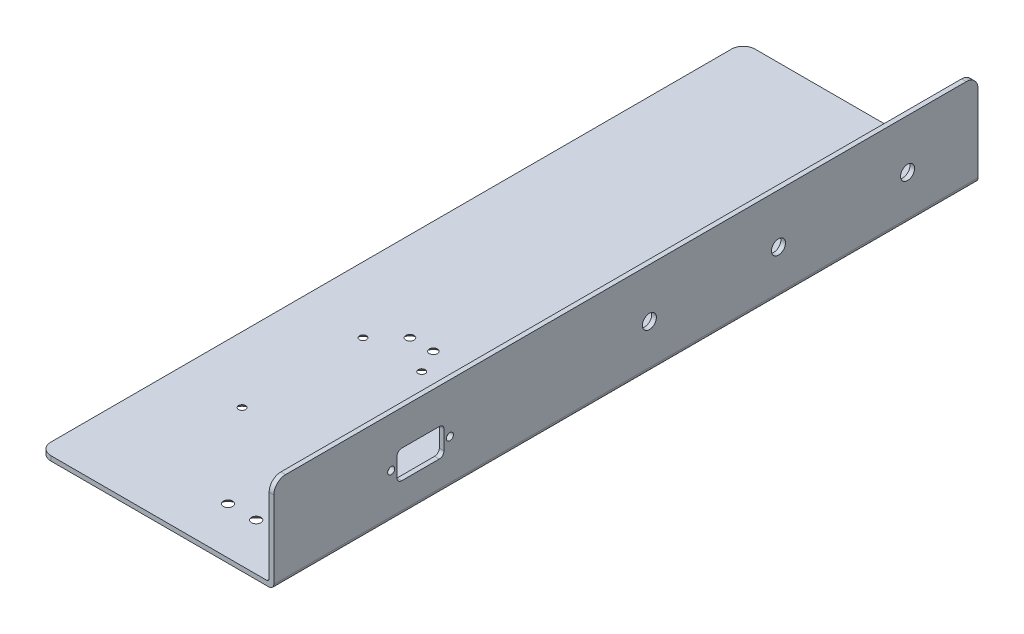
ISO-10303-21;
HEADER;
FILE_DESCRIPTION(('STEP AP214'),'2;1');
FILE_NAME('part.step','',(''),(''),'','','');
FILE_SCHEMA(('AUTOMOTIVE_DESIGN { 1 0 10303 214 1 1 1 1 }'));
ENDSEC;
DATA;
#1=APPLICATION_CONTEXT('core data for automotive mechanical design processes');
#2=APPLICATION_PROTOCOL_DEFINITION('international standard','automotive_design',2000,#1);
#3=PRODUCT_CONTEXT('',#1,'mechanical');
#4=PRODUCT('Part','Part','',(#3));
#5=PRODUCT_RELATED_PRODUCT_CATEGORY('part','',(#4));
#6=PRODUCT_DEFINITION_FORMATION('','',#4);
#7=PRODUCT_DEFINITION_CONTEXT('part definition',#1,'design');
#8=PRODUCT_DEFINITION('design','',#6,#7);
#9=PRODUCT_DEFINITION_SHAPE('','',#8);
#10=(LENGTH_UNIT() NAMED_UNIT(*) SI_UNIT(.MILLI.,.METRE.));
#11=(NAMED_UNIT(*) PLANE_ANGLE_UNIT() SI_UNIT($,.RADIAN.));
#12=(NAMED_UNIT(*) SI_UNIT($,.STERADIAN.) SOLID_ANGLE_UNIT());
#13=UNCERTAINTY_MEASURE_WITH_UNIT(LENGTH_MEASURE(1.E-05),#10,'distance_accuracy_value','');
#14=(GEOMETRIC_REPRESENTATION_CONTEXT(3) GLOBAL_UNCERTAINTY_ASSIGNED_CONTEXT((#13)) GLOBAL_UNIT_ASSIGNED_CONTEXT((#10,
#11,#12)) REPRESENTATION_CONTEXT('',''));
#15=CARTESIAN_POINT('',(0.,0.,0.));
#16=DIRECTION('',(0.,0.,1.));
#17=DIRECTION('',(1.,0.,0.));
#18=AXIS2_PLACEMENT_3D('',#15,#16,#17);
#19=CARTESIAN_POINT('',(-100.,1.99999999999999,300.));
#20=DIRECTION('',(1.,0.,0.));
#21=DIRECTION('',(0.,0.,-1.));
#22=AXIS2_PLACEMENT_3D('',#19,#20,#21);
#23=PLANE('',#22);
#24=DIRECTION('',(0.,0.,-1.));
#25=VECTOR('',#24,1.);
#26=CARTESIAN_POINT('',(-100.,1.99999999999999,300.));
#27=LINE('',#26,#25);
#28=CARTESIAN_POINT('',(-100.,1.99999999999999,295.));
#29=VERTEX_POINT('',#28);
#30=CARTESIAN_POINT('',(-100.,1.99999999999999,5.));
#31=VERTEX_POINT('',#30);
#32=EDGE_CURVE('E208',#29,#31,#27,.T.);
#33=ORIENTED_EDGE('',*,*,#32,.T.);
#34=DIRECTION('',(0.,-1.,0.));
#35=VECTOR('',#34,1.);
#36=CARTESIAN_POINT('',(-100.,1.99999999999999,5.));
#37=LINE('',#36,#35);
#38=CARTESIAN_POINT('',(-100.,0.,5.));
#39=VERTEX_POINT('',#38);
#40=EDGE_CURVE('E324',#31,#39,#37,.T.);
#41=ORIENTED_EDGE('',*,*,#40,.T.);
#42=DIRECTION('',(0.,0.,-1.));
#43=VECTOR('',#42,1.);
#44=CARTESIAN_POINT('',(-100.,0.,300.));
#45=LINE('',#44,#43);
#46=CARTESIAN_POINT('',(-100.,0.,295.));
#47=VERTEX_POINT('',#46);
#48=EDGE_CURVE('E217',#47,#39,#45,.T.);
#49=ORIENTED_EDGE('',*,*,#48,.F.);
#50=DIRECTION('',(0.,-1.,0.));
#51=VECTOR('',#50,1.);
#52=CARTESIAN_POINT('',(-100.,1.99999999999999,295.));
#53=LINE('',#52,#51);
#54=EDGE_CURVE('E322',#47,#29,#53,.F.);
#55=ORIENTED_EDGE('',*,*,#54,.T.);
#56=EDGE_LOOP('',(#33,#41,#49,#55));
#57=FACE_BOUND('',#56,.T.);
#58=ADVANCED_FACE('F35',(#57),#23,.F.);
#59=CARTESIAN_POINT('',(-100.,0.,300.));
#60=DIRECTION('',(0.,1.,0.));
#61=DIRECTION('',(0.,0.,1.));
#62=AXIS2_PLACEMENT_3D('',#59,#60,#61);
#63=PLANE('',#62);
#64=CARTESIAN_POINT('',(-27.5,0.,280.));
#65=DIRECTION('',(0.,1.,0.));
#66=DIRECTION('',(0.,0.,1.));
#67=AXIS2_PLACEMENT_3D('',#64,#65,#66);
#68=CIRCLE('',#67,4.);
#69=CARTESIAN_POINT('',(-27.5,0.,284.));
#70=VERTEX_POINT('',#69);
#71=EDGE_CURVE('E303',#70,#70,#68,.T.);
#72=ORIENTED_EDGE('',*,*,#71,.T.);
#73=EDGE_LOOP('',(#72));
#74=FACE_BOUND('',#73,.T.);
#75=CARTESIAN_POINT('',(-39.5,0.,280.));
#76=DIRECTION('',(0.,1.,0.));
#77=DIRECTION('',(0.,0.,1.));
#78=AXIS2_PLACEMENT_3D('',#75,#76,#77);
#79=CIRCLE('',#78,4.);
#80=CARTESIAN_POINT('',(-39.5,0.,284.));
#81=VERTEX_POINT('',#80);
#82=EDGE_CURVE('E295',#81,#81,#79,.T.);
#83=ORIENTED_EDGE('',*,*,#82,.T.);
#84=EDGE_LOOP('',(#83));
#85=FACE_BOUND('',#84,.T.);
#86=CARTESIAN_POINT('',(-52.,0.,180.));
#87=DIRECTION('',(0.,1.,0.));
#88=DIRECTION('',(0.,0.,1.));
#89=AXIS2_PLACEMENT_3D('',#86,#87,#88);
#90=CIRCLE('',#89,3.75);
#91=CARTESIAN_POINT('',(-52.,0.,183.75));
#92=VERTEX_POINT('',#91);
#93=EDGE_CURVE('E292',#92,#92,#90,.T.);
#94=ORIENTED_EDGE('',*,*,#93,.T.);
#95=EDGE_LOOP('',(#94));
#96=FACE_BOUND('',#95,.T.);
#97=CARTESIAN_POINT('',(-62.,0.,180.));
#98=DIRECTION('',(0.,1.,0.));
#99=DIRECTION('',(0.,0.,1.));
#100=AXIS2_PLACEMENT_3D('',#97,#98,#99);
#101=CIRCLE('',#100,3.75);
#102=CARTESIAN_POINT('',(-62.,0.,183.75));
#103=VERTEX_POINT('',#102);
#104=EDGE_CURVE('E289',#103,#103,#101,.T.);
#105=ORIENTED_EDGE('',*,*,#104,.T.);
#106=EDGE_LOOP('',(#105));
#107=FACE_BOUND('',#106,.T.);
#108=CARTESIAN_POINT('',(-72.,0.,241.5));
#109=DIRECTION('',(0.,1.,0.));
#110=DIRECTION('',(0.,0.,1.));
#111=AXIS2_PLACEMENT_3D('',#108,#109,#110);
#112=CIRCLE('',#111,3.5);
#113=CARTESIAN_POINT('',(-72.,0.,245.));
#114=VERTEX_POINT('',#113);
#115=EDGE_CURVE('E286',#114,#114,#112,.T.);
#116=ORIENTED_EDGE('',*,*,#115,.T.);
#117=EDGE_LOOP('',(#116));
#118=FACE_BOUND('',#117,.T.);
#119=CARTESIAN_POINT('',(-47.,0.,190.));
#120=DIRECTION('',(0.,1.,0.));
#121=DIRECTION('',(0.,0.,1.));
#122=AXIS2_PLACEMENT_3D('',#119,#120,#121);
#123=CIRCLE('',#122,3.49999999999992);
#124=CARTESIAN_POINT('',(-47.,0.,193.5));
#125=VERTEX_POINT('',#124);
#126=EDGE_CURVE('E283',#125,#125,#123,.T.);
#127=ORIENTED_EDGE('',*,*,#126,.T.);
#128=EDGE_LOOP('',(#127));
#129=FACE_BOUND('',#128,.T.);
#130=CARTESIAN_POINT('',(-72.,0.,190.));
#131=DIRECTION('',(0.,1.,0.));
#132=DIRECTION('',(0.,0.,1.));
#133=AXIS2_PLACEMENT_3D('',#130,#131,#132);
#134=CIRCLE('',#133,3.5);
#135=CARTESIAN_POINT('',(-72.,0.,193.5));
#136=VERTEX_POINT('',#135);
#137=EDGE_CURVE('E264',#136,#136,#134,.T.);
#138=ORIENTED_EDGE('',*,*,#137,.T.);
#139=EDGE_LOOP('',(#138));
#140=FACE_BOUND('',#139,.T.);
#141=ORIENTED_EDGE('',*,*,#48,.T.);
#142=CARTESIAN_POINT('',(-95.,0.,5.));
#143=DIRECTION('',(0.,1.,0.));
#144=DIRECTION('',(0.,0.,1.));
#145=AXIS2_PLACEMENT_3D('',#142,#143,#144);
#146=CIRCLE('',#145,5.);
#147=CARTESIAN_POINT('',(-95.,0.,0.));
#148=VERTEX_POINT('',#147);
#149=EDGE_CURVE('E329',#39,#148,#146,.F.);
#150=ORIENTED_EDGE('',*,*,#149,.T.);
#151=DIRECTION('',(1.,0.,0.));
#152=VECTOR('',#151,1.);
#153=CARTESIAN_POINT('',(-100.,0.,0.));
#154=LINE('',#153,#152);
#155=CARTESIAN_POINT('',(-2.,0.,0.));
#156=VERTEX_POINT('',#155);
#157=EDGE_CURVE('E224',#148,#156,#154,.T.);
#158=ORIENTED_EDGE('',*,*,#157,.T.);
#159=DIRECTION('',(0.,0.,-1.));
#160=VECTOR('',#159,1.);
#161=CARTESIAN_POINT('',(-2.,0.,300.));
#162=LINE('',#161,#160);
#163=CARTESIAN_POINT('',(-2.,0.,300.));
#164=VERTEX_POINT('',#163);
#165=EDGE_CURVE('E259',#156,#164,#162,.F.);
#166=ORIENTED_EDGE('',*,*,#165,.T.);
#167=DIRECTION('',(1.,0.,0.));
#168=VECTOR('',#167,1.);
#169=CARTESIAN_POINT('',(-100.,0.,300.));
#170=LINE('',#169,#168);
#171=CARTESIAN_POINT('',(-95.,0.,300.));
#172=VERTEX_POINT('',#171);
#173=EDGE_CURVE('E199',#172,#164,#170,.T.);
#174=ORIENTED_EDGE('',*,*,#173,.F.);
#175=CARTESIAN_POINT('',(-95.,0.,295.));
#176=DIRECTION('',(0.,1.,0.));
#177=DIRECTION('',(0.,0.,1.));
#178=AXIS2_PLACEMENT_3D('',#175,#176,#177);
#179=CIRCLE('',#178,5.);
#180=EDGE_CURVE('E327',#172,#47,#179,.F.);
#181=ORIENTED_EDGE('',*,*,#180,.T.);
#182=EDGE_LOOP('',(#141,#150,#158,#166,#174,#181));
#183=FACE_BOUND('',#182,.T.);
#184=ADVANCED_FACE('F459',(#74,#85,#96,#107,#118,#129,#140,#183),#63,.F.);
#185=CARTESIAN_POINT('',(0.,0.,300.));
#186=DIRECTION('',(-1.,0.,0.));
#187=DIRECTION('',(0.,0.,1.));
#188=AXIS2_PLACEMENT_3D('',#185,#186,#187);
#189=PLANE('',#188);
#190=CARTESIAN_POINT('',(0.,19.,225.));
#191=DIRECTION('',(1.,0.,0.));
#192=DIRECTION('',(0.,0.,-1.));
#193=AXIS2_PLACEMENT_3D('',#190,#191,#192);
#194=CIRCLE('',#193,1.5);
#195=CARTESIAN_POINT('',(0.,19.,223.5));
#196=VERTEX_POINT('',#195);
#197=EDGE_CURVE('E249',#196,#196,#194,.T.);
#198=ORIENTED_EDGE('',*,*,#197,.F.);
#199=EDGE_LOOP('',(#198));
#200=FACE_BOUND('',#199,.T.);
#201=CARTESIAN_POINT('',(0.,19.,250.));
#202=DIRECTION('',(1.,0.,0.));
#203=DIRECTION('',(0.,0.,-1.));
#204=AXIS2_PLACEMENT_3D('',#201,#202,#203);
#205=CIRCLE('',#204,1.5);
#206=CARTESIAN_POINT('',(0.,19.,248.5));
#207=VERTEX_POINT('',#206);
#208=EDGE_CURVE('E246',#207,#207,#205,.T.);
#209=ORIENTED_EDGE('',*,*,#208,.F.);
#210=EDGE_LOOP('',(#209));
#211=FACE_BOUND('',#210,.T.);
#212=DIRECTION('',(0.,0.,-1.));
#213=VECTOR('',#212,1.);
#214=CARTESIAN_POINT('',(0.,13.,247.5));
#215=LINE('',#214,#213);
#216=CARTESIAN_POINT('',(0.,13.,245.5));
#217=VERTEX_POINT('',#216);
#218=CARTESIAN_POINT('',(0.,13.,229.5));
#219=VERTEX_POINT('',#218);
#220=EDGE_CURVE('E399',#217,#219,#215,.T.);
#221=ORIENTED_EDGE('',*,*,#220,.F.);
#222=CARTESIAN_POINT('',(0.,15.,245.5));
#223=DIRECTION('',(-1.,0.,0.));
#224=DIRECTION('',(0.,0.,1.));
#225=AXIS2_PLACEMENT_3D('',#222,#223,#224);
#226=CIRCLE('',#225,2.);
#227=CARTESIAN_POINT('',(0.,15.,247.5));
#228=VERTEX_POINT('',#227);
#229=EDGE_CURVE('E368',#217,#228,#226,.T.);
#230=ORIENTED_EDGE('',*,*,#229,.T.);
#231=DIRECTION('',(0.,-1.,0.));
#232=VECTOR('',#231,1.);
#233=CARTESIAN_POINT('',(0.,25.,247.5));
#234=LINE('',#233,#232);
#235=CARTESIAN_POINT('',(0.,23.,247.5));
#236=VERTEX_POINT('',#235);
#237=EDGE_CURVE('E245',#236,#228,#234,.T.);
#238=ORIENTED_EDGE('',*,*,#237,.F.);
#239=CARTESIAN_POINT('',(0.,23.,245.5));
#240=DIRECTION('',(-1.,0.,0.));
#241=DIRECTION('',(0.,0.,1.));
#242=AXIS2_PLACEMENT_3D('',#239,#240,#241);
#243=CIRCLE('',#242,2.);
#244=CARTESIAN_POINT('',(0.,25.,245.5));
#245=VERTEX_POINT('',#244);
#246=EDGE_CURVE('E43',#236,#245,#243,.T.);
#247=ORIENTED_EDGE('',*,*,#246,.T.);
#248=DIRECTION('',(0.,0.,1.));
#249=VECTOR('',#248,1.);
#250=CARTESIAN_POINT('',(0.,25.,247.5));
#251=LINE('',#250,#249);
#252=CARTESIAN_POINT('',(0.,25.,229.5));
#253=VERTEX_POINT('',#252);
#254=EDGE_CURVE('E378',#253,#245,#251,.T.);
#255=ORIENTED_EDGE('',*,*,#254,.F.);
#256=CARTESIAN_POINT('',(0.,23.,229.5));
#257=DIRECTION('',(-1.,0.,0.));
#258=DIRECTION('',(0.,0.,1.));
#259=AXIS2_PLACEMENT_3D('',#256,#257,#258);
#260=CIRCLE('',#259,2.);
#261=CARTESIAN_POINT('',(0.,23.,227.5));
#262=VERTEX_POINT('',#261);
#263=EDGE_CURVE('E360',#253,#262,#260,.T.);
#264=ORIENTED_EDGE('',*,*,#263,.T.);
#265=DIRECTION('',(0.,1.,0.));
#266=VECTOR('',#265,1.);
#267=CARTESIAN_POINT('',(0.,25.,227.5));
#268=LINE('',#267,#266);
#269=CARTESIAN_POINT('',(0.,15.,227.5));
#270=VERTEX_POINT('',#269);
#271=EDGE_CURVE('E386',#270,#262,#268,.T.);
#272=ORIENTED_EDGE('',*,*,#271,.F.);
#273=CARTESIAN_POINT('',(0.,15.,229.5));
#274=DIRECTION('',(-1.,0.,0.));
#275=DIRECTION('',(0.,0.,1.));
#276=AXIS2_PLACEMENT_3D('',#273,#274,#275);
#277=CIRCLE('',#276,2.);
#278=EDGE_CURVE('E364',#270,#219,#277,.T.);
#279=ORIENTED_EDGE('',*,*,#278,.T.);
#280=EDGE_LOOP('',(#221,#230,#238,#247,#255,#264,#272,#279));
#281=FACE_BOUND('',#280,.T.);
#282=CARTESIAN_POINT('',(0.,19.,140.));
#283=DIRECTION('',(1.,0.,0.));
#284=DIRECTION('',(0.,0.,-1.));
#285=AXIS2_PLACEMENT_3D('',#282,#283,#284);
#286=CIRCLE('',#285,2.99999999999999);
#287=CARTESIAN_POINT('',(0.,19.,137.));
#288=VERTEX_POINT('',#287);
#289=EDGE_CURVE('E233',#288,#288,#286,.T.);
#290=ORIENTED_EDGE('',*,*,#289,.F.);
#291=EDGE_LOOP('',(#290));
#292=FACE_BOUND('',#291,.T.);
#293=CARTESIAN_POINT('',(0.,19.,85.));
#294=DIRECTION('',(1.,0.,0.));
#295=DIRECTION('',(0.,0.,-1.));
#296=AXIS2_PLACEMENT_3D('',#293,#294,#295);
#297=CIRCLE('',#296,3.00000000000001);
#298=CARTESIAN_POINT('',(0.,19.,82.));
#299=VERTEX_POINT('',#298);
#300=EDGE_CURVE('E229',#299,#299,#297,.T.);
#301=ORIENTED_EDGE('',*,*,#300,.F.);
#302=EDGE_LOOP('',(#301));
#303=FACE_BOUND('',#302,.T.);
#304=CARTESIAN_POINT('',(0.,19.,30.));
#305=DIRECTION('',(1.,0.,0.));
#306=DIRECTION('',(0.,0.,-1.));
#307=AXIS2_PLACEMENT_3D('',#304,#305,#306);
#308=CIRCLE('',#307,3.);
#309=CARTESIAN_POINT('',(0.,19.,27.));
#310=VERTEX_POINT('',#309);
#311=EDGE_CURVE('E225',#310,#310,#308,.T.);
#312=ORIENTED_EDGE('',*,*,#311,.F.);
#313=EDGE_LOOP('',(#312));
#314=FACE_BOUND('',#313,.T.);
#315=DIRECTION('',(0.,1.,0.));
#316=VECTOR('',#315,1.);
#317=CARTESIAN_POINT('',(0.,0.,0.));
#318=LINE('',#317,#316);
#319=CARTESIAN_POINT('',(0.,2.,0.));
#320=VERTEX_POINT('',#319);
#321=CARTESIAN_POINT('',(0.,35.,0.));
#322=VERTEX_POINT('',#321);
#323=EDGE_CURVE('E204',#320,#322,#318,.T.);
#324=ORIENTED_EDGE('',*,*,#323,.T.);
#325=CARTESIAN_POINT('',(0.,35.,5.));
#326=DIRECTION('',(-1.,0.,0.));
#327=DIRECTION('',(0.,0.,1.));
#328=AXIS2_PLACEMENT_3D('',#325,#326,#327);
#329=CIRCLE('',#328,5.);
#330=CARTESIAN_POINT('',(0.,40.,5.));
#331=VERTEX_POINT('',#330);
#332=EDGE_CURVE('E320',#322,#331,#329,.F.);
#333=ORIENTED_EDGE('',*,*,#332,.T.);
#334=DIRECTION('',(0.,0.,-1.));
#335=VECTOR('',#334,1.);
#336=CARTESIAN_POINT('',(0.,40.,300.));
#337=LINE('',#336,#335);
#338=CARTESIAN_POINT('',(0.,40.,295.));
#339=VERTEX_POINT('',#338);
#340=EDGE_CURVE('E214',#339,#331,#337,.T.);
#341=ORIENTED_EDGE('',*,*,#340,.F.);
#342=CARTESIAN_POINT('',(0.,35.,295.));
#343=DIRECTION('',(-1.,0.,0.));
#344=DIRECTION('',(0.,0.,1.));
#345=AXIS2_PLACEMENT_3D('',#342,#343,#344);
#346=CIRCLE('',#345,5.);
#347=CARTESIAN_POINT('',(0.,35.,300.));
#348=VERTEX_POINT('',#347);
#349=EDGE_CURVE('E318',#339,#348,#346,.F.);
#350=ORIENTED_EDGE('',*,*,#349,.T.);
#351=DIRECTION('',(0.,1.,0.));
#352=VECTOR('',#351,1.);
#353=CARTESIAN_POINT('',(0.,0.,300.));
#354=LINE('',#353,#352);
#355=CARTESIAN_POINT('',(0.,2.,300.));
#356=VERTEX_POINT('',#355);
#357=EDGE_CURVE('E202',#356,#348,#354,.T.);
#358=ORIENTED_EDGE('',*,*,#357,.F.);
#359=DIRECTION('',(0.,0.,-1.));
#360=VECTOR('',#359,1.);
#361=CARTESIAN_POINT('',(0.,2.,300.));
#362=LINE('',#361,#360);
#363=EDGE_CURVE('E253',#356,#320,#362,.T.);
#364=ORIENTED_EDGE('',*,*,#363,.T.);
#365=EDGE_LOOP('',(#324,#333,#341,#350,#358,#364));
#366=FACE_BOUND('',#365,.T.);
#367=ADVANCED_FACE('F376',(#200,#211,#281,#292,#303,#314,#366),#189,.F.);
#368=CARTESIAN_POINT('',(0.,40.,300.));
#369=DIRECTION('',(0.,-1.,0.));
#370=DIRECTION('',(0.,0.,-1.));
#371=AXIS2_PLACEMENT_3D('',#368,#369,#370);
#372=PLANE('',#371);
#373=ORIENTED_EDGE('',*,*,#340,.T.);
#374=DIRECTION('',(-1.,0.,0.));
#375=VECTOR('',#374,1.);
#376=CARTESIAN_POINT('',(0.,40.,5.));
#377=LINE('',#376,#375);
#378=CARTESIAN_POINT('',(-2.,40.,5.));
#379=VERTEX_POINT('',#378);
#380=EDGE_CURVE('E308',#331,#379,#377,.T.);
#381=ORIENTED_EDGE('',*,*,#380,.T.);
#382=DIRECTION('',(0.,0.,-1.));
#383=VECTOR('',#382,1.);
#384=CARTESIAN_POINT('',(-2.,40.,300.));
#385=LINE('',#384,#383);
#386=CARTESIAN_POINT('',(-2.,40.,295.));
#387=VERTEX_POINT('',#386);
#388=EDGE_CURVE('E211',#387,#379,#385,.T.);
#389=ORIENTED_EDGE('',*,*,#388,.F.);
#390=DIRECTION('',(-1.,0.,0.));
#391=VECTOR('',#390,1.);
#392=CARTESIAN_POINT('',(0.,40.,295.));
#393=LINE('',#392,#391);
#394=EDGE_CURVE('E306',#387,#339,#393,.F.);
#395=ORIENTED_EDGE('',*,*,#394,.T.);
#396=EDGE_LOOP('',(#373,#381,#389,#395));
#397=FACE_BOUND('',#396,.T.);
#398=ADVANCED_FACE('F432',(#397),#372,.F.);
#399=CARTESIAN_POINT('',(-2.,40.,300.));
#400=DIRECTION('',(1.,0.,0.));
#401=DIRECTION('',(0.,1.,0.));
#402=AXIS2_PLACEMENT_3D('',#399,#400,#401);
#403=PLANE('',#402);
#404=CARTESIAN_POINT('',(-2.,19.,225.));
#405=DIRECTION('',(1.,0.,0.));
#406=DIRECTION('',(0.,1.,0.));
#407=AXIS2_PLACEMENT_3D('',#404,#405,#406);
#408=CIRCLE('',#407,1.5);
#409=CARTESIAN_POINT('',(-2.,20.5,225.));
#410=VERTEX_POINT('',#409);
#411=EDGE_CURVE('E247',#410,#410,#408,.T.);
#412=ORIENTED_EDGE('',*,*,#411,.T.);
#413=EDGE_LOOP('',(#412));
#414=FACE_BOUND('',#413,.T.);
#415=CARTESIAN_POINT('',(-2.,19.,250.));
#416=DIRECTION('',(1.,0.,0.));
#417=DIRECTION('',(0.,1.,0.));
#418=AXIS2_PLACEMENT_3D('',#415,#416,#417);
#419=CIRCLE('',#418,1.5);
#420=CARTESIAN_POINT('',(-2.,20.5,250.));
#421=VERTEX_POINT('',#420);
#422=EDGE_CURVE('E242',#421,#421,#419,.T.);
#423=ORIENTED_EDGE('',*,*,#422,.T.);
#424=EDGE_LOOP('',(#423));
#425=FACE_BOUND('',#424,.T.);
#426=DIRECTION('',(0.,1.,0.));
#427=VECTOR('',#426,1.);
#428=CARTESIAN_POINT('',(-2.,40.,227.5));
#429=LINE('',#428,#427);
#430=CARTESIAN_POINT('',(-2.,15.,227.5));
#431=VERTEX_POINT('',#430);
#432=CARTESIAN_POINT('',(-2.,23.,227.5));
#433=VERTEX_POINT('',#432);
#434=EDGE_CURVE('E236',#431,#433,#429,.T.);
#435=ORIENTED_EDGE('',*,*,#434,.T.);
#436=CARTESIAN_POINT('',(-2.,23.,229.5));
#437=DIRECTION('',(1.,0.,0.));
#438=DIRECTION('',(0.,1.,0.));
#439=AXIS2_PLACEMENT_3D('',#436,#437,#438);
#440=CIRCLE('',#439,2.);
#441=CARTESIAN_POINT('',(-2.,25.,229.5));
#442=VERTEX_POINT('',#441);
#443=EDGE_CURVE('E362',#433,#442,#440,.T.);
#444=ORIENTED_EDGE('',*,*,#443,.T.);
#445=DIRECTION('',(0.,0.,1.));
#446=VECTOR('',#445,1.);
#447=CARTESIAN_POINT('',(-2.,25.,300.));
#448=LINE('',#447,#446);
#449=CARTESIAN_POINT('',(-2.,25.,245.5));
#450=VERTEX_POINT('',#449);
#451=EDGE_CURVE('E239',#442,#450,#448,.T.);
#452=ORIENTED_EDGE('',*,*,#451,.T.);
#453=CARTESIAN_POINT('',(-2.,23.,245.5));
#454=DIRECTION('',(1.,0.,0.));
#455=DIRECTION('',(0.,1.,0.));
#456=AXIS2_PLACEMENT_3D('',#453,#454,#455);
#457=CIRCLE('',#456,2.);
#458=CARTESIAN_POINT('',(-2.,23.,247.5));
#459=VERTEX_POINT('',#458);
#460=EDGE_CURVE('E11',#450,#459,#457,.T.);
#461=ORIENTED_EDGE('',*,*,#460,.T.);
#462=DIRECTION('',(0.,-1.,0.));
#463=VECTOR('',#462,1.);
#464=CARTESIAN_POINT('',(-2.,40.,247.5));
#465=LINE('',#464,#463);
#466=CARTESIAN_POINT('',(-2.,15.,247.5));
#467=VERTEX_POINT('',#466);
#468=EDGE_CURVE('E193',#459,#467,#465,.T.);
#469=ORIENTED_EDGE('',*,*,#468,.T.);
#470=CARTESIAN_POINT('',(-2.,15.,245.5));
#471=DIRECTION('',(1.,0.,0.));
#472=DIRECTION('',(0.,1.,0.));
#473=AXIS2_PLACEMENT_3D('',#470,#471,#472);
#474=CIRCLE('',#473,2.);
#475=CARTESIAN_POINT('',(-2.,13.,245.5));
#476=VERTEX_POINT('',#475);
#477=EDGE_CURVE('E370',#467,#476,#474,.T.);
#478=ORIENTED_EDGE('',*,*,#477,.T.);
#479=DIRECTION('',(0.,0.,-1.));
#480=VECTOR('',#479,1.);
#481=CARTESIAN_POINT('',(-2.,13.,300.));
#482=LINE('',#481,#480);
#483=CARTESIAN_POINT('',(-2.,13.,229.5));
#484=VERTEX_POINT('',#483);
#485=EDGE_CURVE('E220',#476,#484,#482,.T.);
#486=ORIENTED_EDGE('',*,*,#485,.T.);
#487=CARTESIAN_POINT('',(-2.,15.,229.5));
#488=DIRECTION('',(1.,0.,0.));
#489=DIRECTION('',(0.,1.,0.));
#490=AXIS2_PLACEMENT_3D('',#487,#488,#489);
#491=CIRCLE('',#490,2.);
#492=EDGE_CURVE('E366',#484,#431,#491,.T.);
#493=ORIENTED_EDGE('',*,*,#492,.T.);
#494=EDGE_LOOP('',(#435,#444,#452,#461,#469,#478,#486,#493));
#495=FACE_BOUND('',#494,.T.);
#496=CARTESIAN_POINT('',(-2.,19.,140.));
#497=DIRECTION('',(1.,0.,0.));
#498=DIRECTION('',(0.,1.,0.));
#499=AXIS2_PLACEMENT_3D('',#496,#497,#498);
#500=CIRCLE('',#499,2.99999999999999);
#501=CARTESIAN_POINT('',(-2.,22.,140.));
#502=VERTEX_POINT('',#501);
#503=EDGE_CURVE('E230',#502,#502,#500,.T.);
#504=ORIENTED_EDGE('',*,*,#503,.T.);
#505=EDGE_LOOP('',(#504));
#506=FACE_BOUND('',#505,.T.);
#507=CARTESIAN_POINT('',(-2.,19.,85.));
#508=DIRECTION('',(1.,0.,0.));
#509=DIRECTION('',(0.,1.,0.));
#510=AXIS2_PLACEMENT_3D('',#507,#508,#509);
#511=CIRCLE('',#510,3.00000000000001);
#512=CARTESIAN_POINT('',(-2.,22.,85.));
#513=VERTEX_POINT('',#512);
#514=EDGE_CURVE('E226',#513,#513,#511,.T.);
#515=ORIENTED_EDGE('',*,*,#514,.T.);
#516=EDGE_LOOP('',(#515));
#517=FACE_BOUND('',#516,.T.);
#518=CARTESIAN_POINT('',(-2.,19.,30.));
#519=DIRECTION('',(1.,0.,0.));
#520=DIRECTION('',(0.,1.,0.));
#521=AXIS2_PLACEMENT_3D('',#518,#519,#520);
#522=CIRCLE('',#521,3.);
#523=CARTESIAN_POINT('',(-2.,22.,30.));
#524=VERTEX_POINT('',#523);
#525=EDGE_CURVE('E221',#524,#524,#522,.T.);
#526=ORIENTED_EDGE('',*,*,#525,.T.);
#527=EDGE_LOOP('',(#526));
#528=FACE_BOUND('',#527,.T.);
#529=ORIENTED_EDGE('',*,*,#388,.T.);
#530=CARTESIAN_POINT('',(-2.,35.,5.));
#531=DIRECTION('',(1.,0.,0.));
#532=DIRECTION('',(0.,1.,0.));
#533=AXIS2_PLACEMENT_3D('',#530,#531,#532);
#534=CIRCLE('',#533,5.);
#535=CARTESIAN_POINT('',(-2.,35.,0.));
#536=VERTEX_POINT('',#535);
#537=EDGE_CURVE('E313',#379,#536,#534,.F.);
#538=ORIENTED_EDGE('',*,*,#537,.T.);
#539=DIRECTION('',(0.,-1.,0.));
#540=VECTOR('',#539,1.);
#541=CARTESIAN_POINT('',(-2.,40.,0.));
#542=LINE('',#541,#540);
#543=CARTESIAN_POINT('',(-2.,3.,0.));
#544=VERTEX_POINT('',#543);
#545=EDGE_CURVE('E200',#536,#544,#542,.T.);
#546=ORIENTED_EDGE('',*,*,#545,.T.);
#547=DIRECTION('',(0.,0.,-1.));
#548=VECTOR('',#547,1.);
#549=CARTESIAN_POINT('',(-2.,3.,300.));
#550=LINE('',#549,#548);
#551=CARTESIAN_POINT('',(-2.,3.,300.));
#552=VERTEX_POINT('',#551);
#553=EDGE_CURVE('E179',#544,#552,#550,.F.);
#554=ORIENTED_EDGE('',*,*,#553,.T.);
#555=DIRECTION('',(0.,-1.,0.));
#556=VECTOR('',#555,1.);
#557=CARTESIAN_POINT('',(-2.,40.,300.));
#558=LINE('',#557,#556);
#559=CARTESIAN_POINT('',(-2.,35.,300.));
#560=VERTEX_POINT('',#559);
#561=EDGE_CURVE('E416',#560,#552,#558,.T.);
#562=ORIENTED_EDGE('',*,*,#561,.F.);
#563=CARTESIAN_POINT('',(-2.,35.,295.));
#564=DIRECTION('',(1.,0.,0.));
#565=DIRECTION('',(0.,1.,0.));
#566=AXIS2_PLACEMENT_3D('',#563,#564,#565);
#567=CIRCLE('',#566,5.);
#568=EDGE_CURVE('E311',#560,#387,#567,.F.);
#569=ORIENTED_EDGE('',*,*,#568,.T.);
#570=EDGE_LOOP('',(#529,#538,#546,#554,#562,#569));
#571=FACE_BOUND('',#570,.T.);
#572=ADVANCED_FACE('F390',(#414,#425,#495,#506,#517,#528,#571),#403,.F.);
#573=CARTESIAN_POINT('',(-2.,2.,300.));
#574=DIRECTION('',(0.,-1.,0.));
#575=DIRECTION('',(1.,0.,0.));
#576=AXIS2_PLACEMENT_3D('',#573,#574,#575);
#577=PLANE('',#576);
#578=CARTESIAN_POINT('',(-39.5,1.99999999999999,280.));
#579=DIRECTION('',(0.,-1.,0.));
#580=DIRECTION('',(1.,0.,0.));
#581=AXIS2_PLACEMENT_3D('',#578,#579,#580);
#582=CIRCLE('',#581,2.);
#583=CARTESIAN_POINT('',(-37.5,2.,280.));
#584=VERTEX_POINT('',#583);
#585=EDGE_CURVE('E298',#584,#584,#582,.T.);
#586=ORIENTED_EDGE('',*,*,#585,.T.);
#587=EDGE_LOOP('',(#586));
#588=FACE_BOUND('',#587,.T.);
#589=CARTESIAN_POINT('',(-27.5,2.,280.));
#590=DIRECTION('',(0.,-1.,0.));
#591=DIRECTION('',(1.,0.,0.));
#592=AXIS2_PLACEMENT_3D('',#589,#590,#591);
#593=CIRCLE('',#592,2.);
#594=CARTESIAN_POINT('',(-25.5,2.,280.));
#595=VERTEX_POINT('',#594);
#596=EDGE_CURVE('E280',#595,#595,#593,.T.);
#597=ORIENTED_EDGE('',*,*,#596,.T.);
#598=EDGE_LOOP('',(#597));
#599=FACE_BOUND('',#598,.T.);
#600=CARTESIAN_POINT('',(-52.,1.99999999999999,180.));
#601=DIRECTION('',(0.,-1.,0.));
#602=DIRECTION('',(1.,0.,0.));
#603=AXIS2_PLACEMENT_3D('',#600,#601,#602);
#604=CIRCLE('',#603,1.75);
#605=CARTESIAN_POINT('',(-50.25,1.99999999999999,180.));
#606=VERTEX_POINT('',#605);
#607=EDGE_CURVE('E277',#606,#606,#604,.T.);
#608=ORIENTED_EDGE('',*,*,#607,.T.);
#609=EDGE_LOOP('',(#608));
#610=FACE_BOUND('',#609,.T.);
#611=CARTESIAN_POINT('',(-62.,1.99999999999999,180.));
#612=DIRECTION('',(0.,-1.,0.));
#613=DIRECTION('',(1.,0.,0.));
#614=AXIS2_PLACEMENT_3D('',#611,#612,#613);
#615=CIRCLE('',#614,1.75);
#616=CARTESIAN_POINT('',(-60.25,1.99999999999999,180.));
#617=VERTEX_POINT('',#616);
#618=EDGE_CURVE('E274',#617,#617,#615,.T.);
#619=ORIENTED_EDGE('',*,*,#618,.T.);
#620=EDGE_LOOP('',(#619));
#621=FACE_BOUND('',#620,.T.);
#622=CARTESIAN_POINT('',(-72.,1.99999999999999,190.));
#623=DIRECTION('',(0.,-1.,0.));
#624=DIRECTION('',(1.,0.,0.));
#625=AXIS2_PLACEMENT_3D('',#622,#623,#624);
#626=CIRCLE('',#625,1.5);
#627=CARTESIAN_POINT('',(-70.5,1.99999999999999,190.));
#628=VERTEX_POINT('',#627);
#629=EDGE_CURVE('E271',#628,#628,#626,.T.);
#630=ORIENTED_EDGE('',*,*,#629,.T.);
#631=EDGE_LOOP('',(#630));
#632=FACE_BOUND('',#631,.T.);
#633=CARTESIAN_POINT('',(-47.,1.99999999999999,190.));
#634=DIRECTION('',(0.,-1.,0.));
#635=DIRECTION('',(1.,0.,0.));
#636=AXIS2_PLACEMENT_3D('',#633,#634,#635);
#637=CIRCLE('',#636,1.5);
#638=CARTESIAN_POINT('',(-45.5,1.99999999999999,190.));
#639=VERTEX_POINT('',#638);
#640=EDGE_CURVE('E268',#639,#639,#637,.T.);
#641=ORIENTED_EDGE('',*,*,#640,.T.);
#642=EDGE_LOOP('',(#641));
#643=FACE_BOUND('',#642,.T.);
#644=CARTESIAN_POINT('',(-72.,1.99999999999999,241.5));
#645=DIRECTION('',(0.,-1.,0.));
#646=DIRECTION('',(1.,0.,0.));
#647=AXIS2_PLACEMENT_3D('',#644,#645,#646);
#648=CIRCLE('',#647,1.5);
#649=CARTESIAN_POINT('',(-70.5,1.99999999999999,241.5));
#650=VERTEX_POINT('',#649);
#651=EDGE_CURVE('E265',#650,#650,#648,.T.);
#652=ORIENTED_EDGE('',*,*,#651,.T.);
#653=EDGE_LOOP('',(#652));
#654=FACE_BOUND('',#653,.T.);
#655=DIRECTION('',(-1.,0.,0.));
#656=VECTOR('',#655,1.);
#657=CARTESIAN_POINT('',(-2.,2.,0.));
#658=LINE('',#657,#656);
#659=CARTESIAN_POINT('',(-3.,2.,0.));
#660=VERTEX_POINT('',#659);
#661=CARTESIAN_POINT('',(-95.,1.99999999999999,0.));
#662=VERTEX_POINT('',#661);
#663=EDGE_CURVE('E189',#660,#662,#658,.T.);
#664=ORIENTED_EDGE('',*,*,#663,.T.);
#665=CARTESIAN_POINT('',(-95.,1.99999999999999,5.));
#666=DIRECTION('',(0.,-1.,0.));
#667=DIRECTION('',(1.,0.,0.));
#668=AXIS2_PLACEMENT_3D('',#665,#666,#667);
#669=CIRCLE('',#668,5.);
#670=EDGE_CURVE('E333',#662,#31,#669,.F.);
#671=ORIENTED_EDGE('',*,*,#670,.T.);
#672=ORIENTED_EDGE('',*,*,#32,.F.);
#673=CARTESIAN_POINT('',(-95.,1.99999999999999,295.));
#674=DIRECTION('',(0.,-1.,0.));
#675=DIRECTION('',(1.,0.,0.));
#676=AXIS2_PLACEMENT_3D('',#673,#674,#675);
#677=CIRCLE('',#676,5.);
#678=CARTESIAN_POINT('',(-95.,1.99999999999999,300.));
#679=VERTEX_POINT('',#678);
#680=EDGE_CURVE('E331',#29,#679,#677,.F.);
#681=ORIENTED_EDGE('',*,*,#680,.T.);
#682=DIRECTION('',(-1.,0.,0.));
#683=VECTOR('',#682,1.);
#684=CARTESIAN_POINT('',(-2.,2.,300.));
#685=LINE('',#684,#683);
#686=CARTESIAN_POINT('',(-3.,2.,300.));
#687=VERTEX_POINT('',#686);
#688=EDGE_CURVE('E192',#687,#679,#685,.T.);
#689=ORIENTED_EDGE('',*,*,#688,.F.);
#690=DIRECTION('',(0.,0.,-1.));
#691=VECTOR('',#690,1.);
#692=CARTESIAN_POINT('',(-3.,2.,0.));
#693=LINE('',#692,#691);
#694=EDGE_CURVE('E177',#687,#660,#693,.T.);
#695=ORIENTED_EDGE('',*,*,#694,.T.);
#696=EDGE_LOOP('',(#664,#671,#672,#681,#689,#695));
#697=FACE_BOUND('',#696,.T.);
#698=ADVANCED_FACE('F188',(#588,#599,#610,#621,#632,#643,#654,#697),#577,.F.);
#699=CARTESIAN_POINT('',(0.,0.,300.));
#700=DIRECTION('',(0.,0.,1.));
#701=DIRECTION('',(1.,0.,0.));
#702=AXIS2_PLACEMENT_3D('',#699,#700,#701);
#703=PLANE('',#702);
#704=ORIENTED_EDGE('',*,*,#688,.T.);
#705=DIRECTION('',(0.,-1.,0.));
#706=VECTOR('',#705,1.);
#707=CARTESIAN_POINT('',(-95.,0.,300.));
#708=LINE('',#707,#706);
#709=EDGE_CURVE('E338',#679,#172,#708,.T.);
#710=ORIENTED_EDGE('',*,*,#709,.T.);
#711=ORIENTED_EDGE('',*,*,#173,.T.);
#712=CARTESIAN_POINT('',(-2.,2.,300.));
#713=DIRECTION('',(0.,0.,1.));
#714=DIRECTION('',(1.,0.,0.));
#715=AXIS2_PLACEMENT_3D('',#712,#713,#714);
#716=CIRCLE('',#715,2.);
#717=EDGE_CURVE('E262',#164,#356,#716,.T.);
#718=ORIENTED_EDGE('',*,*,#717,.T.);
#719=ORIENTED_EDGE('',*,*,#357,.T.);
#720=DIRECTION('',(-1.,0.,0.));
#721=VECTOR('',#720,1.);
#722=CARTESIAN_POINT('',(-2.,35.,300.));
#723=LINE('',#722,#721);
#724=EDGE_CURVE('E335',#348,#560,#723,.T.);
#725=ORIENTED_EDGE('',*,*,#724,.T.);
#726=ORIENTED_EDGE('',*,*,#561,.T.);
#727=CARTESIAN_POINT('',(-3.,3.,300.));
#728=DIRECTION('',(0.,0.,1.));
#729=DIRECTION('',(1.,0.,0.));
#730=AXIS2_PLACEMENT_3D('',#727,#728,#729);
#731=CIRCLE('',#730,1.);
#732=EDGE_CURVE('E183',#552,#687,#731,.F.);
#733=ORIENTED_EDGE('',*,*,#732,.T.);
#734=EDGE_LOOP('',(#704,#710,#711,#718,#719,#725,#726,#733));
#735=FACE_BOUND('',#734,.T.);
#736=ADVANCED_FACE('F441',(#735),#703,.T.);
#737=CARTESIAN_POINT('',(0.,0.,0.));
#738=DIRECTION('',(0.,0.,1.));
#739=DIRECTION('',(1.,0.,0.));
#740=AXIS2_PLACEMENT_3D('',#737,#738,#739);
#741=PLANE('',#740);
#742=ORIENTED_EDGE('',*,*,#545,.F.);
#743=DIRECTION('',(-1.,0.,0.));
#744=VECTOR('',#743,1.);
#745=CARTESIAN_POINT('',(0.,35.,0.));
#746=LINE('',#745,#744);
#747=EDGE_CURVE('E316',#536,#322,#746,.F.);
#748=ORIENTED_EDGE('',*,*,#747,.T.);
#749=ORIENTED_EDGE('',*,*,#323,.F.);
#750=CARTESIAN_POINT('',(-2.,2.,0.));
#751=DIRECTION('',(0.,0.,1.));
#752=DIRECTION('',(1.,0.,0.));
#753=AXIS2_PLACEMENT_3D('',#750,#751,#752);
#754=CIRCLE('',#753,2.);
#755=EDGE_CURVE('E256',#320,#156,#754,.F.);
#756=ORIENTED_EDGE('',*,*,#755,.T.);
#757=ORIENTED_EDGE('',*,*,#157,.F.);
#758=DIRECTION('',(0.,-1.,0.));
#759=VECTOR('',#758,1.);
#760=CARTESIAN_POINT('',(-95.,0.,0.));
#761=LINE('',#760,#759);
#762=EDGE_CURVE('E198',#148,#662,#761,.F.);
#763=ORIENTED_EDGE('',*,*,#762,.T.);
#764=ORIENTED_EDGE('',*,*,#663,.F.);
#765=CARTESIAN_POINT('',(-3.,3.,0.));
#766=DIRECTION('',(0.,0.,1.));
#767=DIRECTION('',(1.,0.,0.));
#768=AXIS2_PLACEMENT_3D('',#765,#766,#767);
#769=CIRCLE('',#768,1.);
#770=EDGE_CURVE('E173',#660,#544,#769,.T.);
#771=ORIENTED_EDGE('',*,*,#770,.T.);
#772=EDGE_LOOP('',(#742,#748,#749,#756,#757,#763,#764,#771));
#773=FACE_BOUND('',#772,.T.);
#774=ADVANCED_FACE('F195',(#773),#741,.F.);
#775=CARTESIAN_POINT('',(-100.,19.,30.));
#776=DIRECTION('',(1.,0.,0.));
#777=DIRECTION('',(0.,0.,-1.));
#778=AXIS2_PLACEMENT_3D('',#775,#776,#777);
#779=CYLINDRICAL_SURFACE('',#778,3.);
#780=ORIENTED_EDGE('',*,*,#311,.T.);
#781=EDGE_LOOP('',(#780));
#782=FACE_BOUND('',#781,.T.);
#783=ORIENTED_EDGE('',*,*,#525,.F.);
#784=EDGE_LOOP('',(#783));
#785=FACE_BOUND('',#784,.T.);
#786=ADVANCED_FACE('F637',(#782,#785),#779,.F.);
#787=CARTESIAN_POINT('',(-100.,19.,85.));
#788=DIRECTION('',(1.,0.,0.));
#789=DIRECTION('',(0.,0.,-1.));
#790=AXIS2_PLACEMENT_3D('',#787,#788,#789);
#791=CYLINDRICAL_SURFACE('',#790,3.00000000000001);
#792=ORIENTED_EDGE('',*,*,#300,.T.);
#793=EDGE_LOOP('',(#792));
#794=FACE_BOUND('',#793,.T.);
#795=ORIENTED_EDGE('',*,*,#514,.F.);
#796=EDGE_LOOP('',(#795));
#797=FACE_BOUND('',#796,.T.);
#798=ADVANCED_FACE('F744',(#794,#797),#791,.F.);
#799=CARTESIAN_POINT('',(-100.,19.,140.));
#800=DIRECTION('',(1.,0.,0.));
#801=DIRECTION('',(0.,0.,-1.));
#802=AXIS2_PLACEMENT_3D('',#799,#800,#801);
#803=CYLINDRICAL_SURFACE('',#802,2.99999999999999);
#804=ORIENTED_EDGE('',*,*,#289,.T.);
#805=EDGE_LOOP('',(#804));
#806=FACE_BOUND('',#805,.T.);
#807=ORIENTED_EDGE('',*,*,#503,.F.);
#808=EDGE_LOOP('',(#807));
#809=FACE_BOUND('',#808,.T.);
#810=ADVANCED_FACE('F582',(#806,#809),#803,.F.);
#811=CARTESIAN_POINT('',(-100.,25.,247.5));
#812=DIRECTION('',(0.,0.,1.));
#813=DIRECTION('',(1.,0.,0.));
#814=AXIS2_PLACEMENT_3D('',#811,#812,#813);
#815=PLANE('',#814);
#816=ORIENTED_EDGE('',*,*,#237,.T.);
#817=DIRECTION('',(1.,0.,0.));
#818=VECTOR('',#817,1.);
#819=CARTESIAN_POINT('',(-2.,15.,247.5));
#820=LINE('',#819,#818);
#821=EDGE_CURVE('E50',#228,#467,#820,.F.);
#822=ORIENTED_EDGE('',*,*,#821,.T.);
#823=ORIENTED_EDGE('',*,*,#468,.F.);
#824=DIRECTION('',(1.,0.,0.));
#825=VECTOR('',#824,1.);
#826=CARTESIAN_POINT('',(0.,23.,247.5));
#827=LINE('',#826,#825);
#828=EDGE_CURVE('E356',#459,#236,#827,.T.);
#829=ORIENTED_EDGE('',*,*,#828,.T.);
#830=EDGE_LOOP('',(#816,#822,#823,#829));
#831=FACE_BOUND('',#830,.T.);
#832=ADVANCED_FACE('F388',(#831),#815,.F.);
#833=CARTESIAN_POINT('',(-100.,25.,247.5));
#834=DIRECTION('',(0.,1.,0.));
#835=DIRECTION('',(0.,0.,1.));
#836=AXIS2_PLACEMENT_3D('',#833,#834,#835);
#837=PLANE('',#836);
#838=ORIENTED_EDGE('',*,*,#451,.F.);
#839=DIRECTION('',(1.,0.,0.));
#840=VECTOR('',#839,1.);
#841=CARTESIAN_POINT('',(0.,25.,229.5));
#842=LINE('',#841,#840);
#843=EDGE_CURVE('E343',#442,#253,#842,.T.);
#844=ORIENTED_EDGE('',*,*,#843,.T.);
#845=ORIENTED_EDGE('',*,*,#254,.T.);
#846=DIRECTION('',(1.,0.,0.));
#847=VECTOR('',#846,1.);
#848=CARTESIAN_POINT('',(-2.,25.,245.5));
#849=LINE('',#848,#847);
#850=EDGE_CURVE('E341',#245,#450,#849,.F.);
#851=ORIENTED_EDGE('',*,*,#850,.T.);
#852=EDGE_LOOP('',(#838,#844,#845,#851));
#853=FACE_BOUND('',#852,.T.);
#854=ADVANCED_FACE('F384',(#853),#837,.F.);
#855=CARTESIAN_POINT('',(-100.,25.,227.5));
#856=DIRECTION('',(0.,0.,-1.));
#857=DIRECTION('',(-1.,0.,0.));
#858=AXIS2_PLACEMENT_3D('',#855,#856,#857);
#859=PLANE('',#858);
#860=ORIENTED_EDGE('',*,*,#271,.T.);
#861=DIRECTION('',(1.,0.,0.));
#862=VECTOR('',#861,1.);
#863=CARTESIAN_POINT('',(-2.,23.,227.5));
#864=LINE('',#863,#862);
#865=EDGE_CURVE('E349',#262,#433,#864,.F.);
#866=ORIENTED_EDGE('',*,*,#865,.T.);
#867=ORIENTED_EDGE('',*,*,#434,.F.);
#868=DIRECTION('',(1.,0.,0.));
#869=VECTOR('',#868,1.);
#870=CARTESIAN_POINT('',(0.,15.,227.5));
#871=LINE('',#870,#869);
#872=EDGE_CURVE('E346',#431,#270,#871,.T.);
#873=ORIENTED_EDGE('',*,*,#872,.T.);
#874=EDGE_LOOP('',(#860,#866,#867,#873));
#875=FACE_BOUND('',#874,.T.);
#876=ADVANCED_FACE('F554',(#875),#859,.F.);
#877=CARTESIAN_POINT('',(-100.,13.,247.5));
#878=DIRECTION('',(0.,-1.,0.));
#879=DIRECTION('',(0.,0.,-1.));
#880=AXIS2_PLACEMENT_3D('',#877,#878,#879);
#881=PLANE('',#880);
#882=ORIENTED_EDGE('',*,*,#220,.T.);
#883=DIRECTION('',(1.,0.,0.));
#884=VECTOR('',#883,1.);
#885=CARTESIAN_POINT('',(-2.,13.,229.5));
#886=LINE('',#885,#884);
#887=EDGE_CURVE('E354',#219,#484,#886,.F.);
#888=ORIENTED_EDGE('',*,*,#887,.T.);
#889=ORIENTED_EDGE('',*,*,#485,.F.);
#890=DIRECTION('',(1.,0.,0.));
#891=VECTOR('',#890,1.);
#892=CARTESIAN_POINT('',(0.,13.,245.5));
#893=LINE('',#892,#891);
#894=EDGE_CURVE('E351',#476,#217,#893,.T.);
#895=ORIENTED_EDGE('',*,*,#894,.T.);
#896=EDGE_LOOP('',(#882,#888,#889,#895));
#897=FACE_BOUND('',#896,.T.);
#898=ADVANCED_FACE('F398',(#897),#881,.F.);
#899=CARTESIAN_POINT('',(-100.,19.,250.));
#900=DIRECTION('',(1.,0.,0.));
#901=DIRECTION('',(0.,0.,-1.));
#902=AXIS2_PLACEMENT_3D('',#899,#900,#901);
#903=CYLINDRICAL_SURFACE('',#902,1.5);
#904=ORIENTED_EDGE('',*,*,#208,.T.);
#905=EDGE_LOOP('',(#904));
#906=FACE_BOUND('',#905,.T.);
#907=ORIENTED_EDGE('',*,*,#422,.F.);
#908=EDGE_LOOP('',(#907));
#909=FACE_BOUND('',#908,.T.);
#910=ADVANCED_FACE('F553',(#906,#909),#903,.F.);
#911=CARTESIAN_POINT('',(-100.,19.,225.));
#912=DIRECTION('',(1.,0.,0.));
#913=DIRECTION('',(0.,0.,-1.));
#914=AXIS2_PLACEMENT_3D('',#911,#912,#913);
#915=CYLINDRICAL_SURFACE('',#914,1.5);
#916=ORIENTED_EDGE('',*,*,#197,.T.);
#917=EDGE_LOOP('',(#916));
#918=FACE_BOUND('',#917,.T.);
#919=ORIENTED_EDGE('',*,*,#411,.F.);
#920=EDGE_LOOP('',(#919));
#921=FACE_BOUND('',#920,.T.);
#922=ADVANCED_FACE('F475',(#918,#921),#915,.F.);
#923=CARTESIAN_POINT('',(-3.,3.,300.));
#924=DIRECTION('',(0.,0.,1.));
#925=DIRECTION('',(1.,0.,0.));
#926=AXIS2_PLACEMENT_3D('',#923,#924,#925);
#927=CYLINDRICAL_SURFACE('',#926,1.);
#928=ORIENTED_EDGE('',*,*,#732,.F.);
#929=ORIENTED_EDGE('',*,*,#553,.F.);
#930=ORIENTED_EDGE('',*,*,#770,.F.);
#931=ORIENTED_EDGE('',*,*,#694,.F.);
#932=EDGE_LOOP('',(#928,#929,#930,#931));
#933=FACE_BOUND('',#932,.T.);
#934=ADVANCED_FACE('F176',(#933),#927,.F.);
#935=CARTESIAN_POINT('',(-2.,2.,300.));
#936=DIRECTION('',(0.,0.,-1.));
#937=DIRECTION('',(-1.,0.,0.));
#938=AXIS2_PLACEMENT_3D('',#935,#936,#937);
#939=CYLINDRICAL_SURFACE('',#938,2.);
#940=ORIENTED_EDGE('',*,*,#717,.F.);
#941=ORIENTED_EDGE('',*,*,#165,.F.);
#942=ORIENTED_EDGE('',*,*,#755,.F.);
#943=ORIENTED_EDGE('',*,*,#363,.F.);
#944=EDGE_LOOP('',(#940,#941,#942,#943));
#945=FACE_BOUND('',#944,.T.);
#946=ADVANCED_FACE('F444',(#945),#939,.T.);
#947=CARTESIAN_POINT('',(-52.,2.00000000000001,180.));
#948=DIRECTION('',(0.,-1.,0.));
#949=DIRECTION('',(0.,0.,-1.));
#950=AXIS2_PLACEMENT_3D('',#947,#948,#949);
#951=CONICAL_SURFACE('',#950,1.75,0.785398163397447);
#952=ORIENTED_EDGE('',*,*,#93,.F.);
#953=EDGE_LOOP('',(#952));
#954=FACE_BOUND('',#953,.T.);
#955=ORIENTED_EDGE('',*,*,#607,.F.);
#956=EDGE_LOOP('',(#955));
#957=FACE_BOUND('',#956,.T.);
#958=ADVANCED_FACE('F478',(#954,#957),#951,.F.);
#959=CARTESIAN_POINT('',(-62.,2.00000000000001,180.));
#960=DIRECTION('',(0.,-1.,0.));
#961=DIRECTION('',(0.,0.,-1.));
#962=AXIS2_PLACEMENT_3D('',#959,#960,#961);
#963=CONICAL_SURFACE('',#962,1.75,0.785398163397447);
#964=ORIENTED_EDGE('',*,*,#104,.F.);
#965=EDGE_LOOP('',(#964));
#966=FACE_BOUND('',#965,.T.);
#967=ORIENTED_EDGE('',*,*,#618,.F.);
#968=EDGE_LOOP('',(#967));
#969=FACE_BOUND('',#968,.T.);
#970=ADVANCED_FACE('F481',(#966,#969),#963,.F.);
#971=CARTESIAN_POINT('',(-72.,2.00000000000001,241.5));
#972=DIRECTION('',(0.,-1.,0.));
#973=DIRECTION('',(0.,0.,-1.));
#974=AXIS2_PLACEMENT_3D('',#971,#972,#973);
#975=CONICAL_SURFACE('',#974,1.5,0.785398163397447);
#976=ORIENTED_EDGE('',*,*,#115,.F.);
#977=EDGE_LOOP('',(#976));
#978=FACE_BOUND('',#977,.T.);
#979=ORIENTED_EDGE('',*,*,#651,.F.);
#980=EDGE_LOOP('',(#979));
#981=FACE_BOUND('',#980,.T.);
#982=ADVANCED_FACE('F485',(#978,#981),#975,.F.);
#983=CARTESIAN_POINT('',(-47.,1.99999999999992,190.));
#984=DIRECTION('',(0.,-1.,0.));
#985=DIRECTION('',(0.,0.,-1.));
#986=AXIS2_PLACEMENT_3D('',#983,#984,#985);
#987=CONICAL_SURFACE('',#986,1.5,0.785398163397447);
#988=ORIENTED_EDGE('',*,*,#126,.F.);
#989=EDGE_LOOP('',(#988));
#990=FACE_BOUND('',#989,.T.);
#991=ORIENTED_EDGE('',*,*,#640,.F.);
#992=EDGE_LOOP('',(#991));
#993=FACE_BOUND('',#992,.T.);
#994=ADVANCED_FACE('F489',(#990,#993),#987,.F.);
#995=CARTESIAN_POINT('',(-72.,2.00000000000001,190.));
#996=DIRECTION('',(0.,-1.,0.));
#997=DIRECTION('',(0.,0.,-1.));
#998=AXIS2_PLACEMENT_3D('',#995,#996,#997);
#999=CONICAL_SURFACE('',#998,1.5,0.785398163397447);
#1000=ORIENTED_EDGE('',*,*,#137,.F.);
#1001=EDGE_LOOP('',(#1000));
#1002=FACE_BOUND('',#1001,.T.);
#1003=ORIENTED_EDGE('',*,*,#629,.F.);
#1004=EDGE_LOOP('',(#1003));
#1005=FACE_BOUND('',#1004,.T.);
#1006=ADVANCED_FACE('F493',(#1002,#1005),#999,.F.);
#1007=CARTESIAN_POINT('',(-27.5,1.99999999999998,280.));
#1008=DIRECTION('',(0.,-1.,0.));
#1009=DIRECTION('',(0.,0.,-1.));
#1010=AXIS2_PLACEMENT_3D('',#1007,#1008,#1009);
#1011=CONICAL_SURFACE('',#1010,2.,0.785398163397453);
#1012=ORIENTED_EDGE('',*,*,#71,.F.);
#1013=EDGE_LOOP('',(#1012));
#1014=FACE_BOUND('',#1013,.T.);
#1015=ORIENTED_EDGE('',*,*,#596,.F.);
#1016=EDGE_LOOP('',(#1015));
#1017=FACE_BOUND('',#1016,.T.);
#1018=ADVANCED_FACE('F497',(#1014,#1017),#1011,.F.);
#1019=CARTESIAN_POINT('',(-39.5,1.99999999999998,280.));
#1020=DIRECTION('',(0.,-1.,0.));
#1021=DIRECTION('',(0.,0.,-1.));
#1022=AXIS2_PLACEMENT_3D('',#1019,#1020,#1021);
#1023=CONICAL_SURFACE('',#1022,2.,0.785398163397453);
#1024=ORIENTED_EDGE('',*,*,#82,.F.);
#1025=EDGE_LOOP('',(#1024));
#1026=FACE_BOUND('',#1025,.T.);
#1027=ORIENTED_EDGE('',*,*,#585,.F.);
#1028=EDGE_LOOP('',(#1027));
#1029=FACE_BOUND('',#1028,.T.);
#1030=ADVANCED_FACE('F501',(#1026,#1029),#1023,.F.);
#1031=CARTESIAN_POINT('',(0.,35.,5.));
#1032=DIRECTION('',(-1.,0.,0.));
#1033=DIRECTION('',(0.,0.,1.));
#1034=AXIS2_PLACEMENT_3D('',#1031,#1032,#1033);
#1035=CYLINDRICAL_SURFACE('',#1034,5.);
#1036=ORIENTED_EDGE('',*,*,#332,.F.);
#1037=ORIENTED_EDGE('',*,*,#747,.F.);
#1038=ORIENTED_EDGE('',*,*,#537,.F.);
#1039=ORIENTED_EDGE('',*,*,#380,.F.);
#1040=EDGE_LOOP('',(#1036,#1037,#1038,#1039));
#1041=FACE_BOUND('',#1040,.T.);
#1042=ADVANCED_FACE('F429',(#1041),#1035,.T.);
#1043=CARTESIAN_POINT('',(-95.,1.99999999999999,5.));
#1044=DIRECTION('',(0.,-1.,0.));
#1045=DIRECTION('',(0.,0.,-1.));
#1046=AXIS2_PLACEMENT_3D('',#1043,#1044,#1045);
#1047=CYLINDRICAL_SURFACE('',#1046,5.);
#1048=ORIENTED_EDGE('',*,*,#670,.F.);
#1049=ORIENTED_EDGE('',*,*,#762,.F.);
#1050=ORIENTED_EDGE('',*,*,#149,.F.);
#1051=ORIENTED_EDGE('',*,*,#40,.F.);
#1052=EDGE_LOOP('',(#1048,#1049,#1050,#1051));
#1053=FACE_BOUND('',#1052,.T.);
#1054=ADVANCED_FACE('F448',(#1053),#1047,.T.);
#1055=CARTESIAN_POINT('',(-95.,0.,295.));
#1056=DIRECTION('',(0.,1.,0.));
#1057=DIRECTION('',(0.,0.,1.));
#1058=AXIS2_PLACEMENT_3D('',#1055,#1056,#1057);
#1059=CYLINDRICAL_SURFACE('',#1058,5.);
#1060=ORIENTED_EDGE('',*,*,#680,.F.);
#1061=ORIENTED_EDGE('',*,*,#54,.F.);
#1062=ORIENTED_EDGE('',*,*,#180,.F.);
#1063=ORIENTED_EDGE('',*,*,#709,.F.);
#1064=EDGE_LOOP('',(#1060,#1061,#1062,#1063));
#1065=FACE_BOUND('',#1064,.T.);
#1066=ADVANCED_FACE('F456',(#1065),#1059,.T.);
#1067=CARTESIAN_POINT('',(0.,35.,295.));
#1068=DIRECTION('',(1.,0.,0.));
#1069=DIRECTION('',(0.,0.,-1.));
#1070=AXIS2_PLACEMENT_3D('',#1067,#1068,#1069);
#1071=CYLINDRICAL_SURFACE('',#1070,5.);
#1072=ORIENTED_EDGE('',*,*,#349,.F.);
#1073=ORIENTED_EDGE('',*,*,#394,.F.);
#1074=ORIENTED_EDGE('',*,*,#568,.F.);
#1075=ORIENTED_EDGE('',*,*,#724,.F.);
#1076=EDGE_LOOP('',(#1072,#1073,#1074,#1075));
#1077=FACE_BOUND('',#1076,.T.);
#1078=ADVANCED_FACE('F439',(#1077),#1071,.T.);
#1079=CARTESIAN_POINT('',(-100.,23.,229.5));
#1080=DIRECTION('',(-1.,0.,0.));
#1081=DIRECTION('',(0.,0.,1.));
#1082=AXIS2_PLACEMENT_3D('',#1079,#1080,#1081);
#1083=CYLINDRICAL_SURFACE('',#1082,2.);
#1084=ORIENTED_EDGE('',*,*,#443,.F.);
#1085=ORIENTED_EDGE('',*,*,#865,.F.);
#1086=ORIENTED_EDGE('',*,*,#263,.F.);
#1087=ORIENTED_EDGE('',*,*,#843,.F.);
#1088=EDGE_LOOP('',(#1084,#1085,#1086,#1087));
#1089=FACE_BOUND('',#1088,.T.);
#1090=ADVANCED_FACE('F514',(#1089),#1083,.F.);
#1091=CARTESIAN_POINT('',(-100.,15.,229.5));
#1092=DIRECTION('',(-1.,0.,0.));
#1093=DIRECTION('',(0.,0.,1.));
#1094=AXIS2_PLACEMENT_3D('',#1091,#1092,#1093);
#1095=CYLINDRICAL_SURFACE('',#1094,2.);
#1096=ORIENTED_EDGE('',*,*,#492,.F.);
#1097=ORIENTED_EDGE('',*,*,#887,.F.);
#1098=ORIENTED_EDGE('',*,*,#278,.F.);
#1099=ORIENTED_EDGE('',*,*,#872,.F.);
#1100=EDGE_LOOP('',(#1096,#1097,#1098,#1099));
#1101=FACE_BOUND('',#1100,.T.);
#1102=ADVANCED_FACE('F517',(#1101),#1095,.F.);
#1103=CARTESIAN_POINT('',(-100.,15.,245.5));
#1104=DIRECTION('',(-1.,0.,0.));
#1105=DIRECTION('',(0.,0.,1.));
#1106=AXIS2_PLACEMENT_3D('',#1103,#1104,#1105);
#1107=CYLINDRICAL_SURFACE('',#1106,2.);
#1108=ORIENTED_EDGE('',*,*,#477,.F.);
#1109=ORIENTED_EDGE('',*,*,#821,.F.);
#1110=ORIENTED_EDGE('',*,*,#229,.F.);
#1111=ORIENTED_EDGE('',*,*,#894,.F.);
#1112=EDGE_LOOP('',(#1108,#1109,#1110,#1111));
#1113=FACE_BOUND('',#1112,.T.);
#1114=ADVANCED_FACE('F395',(#1113),#1107,.F.);
#1115=CARTESIAN_POINT('',(-100.,23.,245.5));
#1116=DIRECTION('',(-1.,0.,0.));
#1117=DIRECTION('',(0.,0.,1.));
#1118=AXIS2_PLACEMENT_3D('',#1115,#1116,#1117);
#1119=CYLINDRICAL_SURFACE('',#1118,2.);
#1120=ORIENTED_EDGE('',*,*,#460,.F.);
#1121=ORIENTED_EDGE('',*,*,#850,.F.);
#1122=ORIENTED_EDGE('',*,*,#246,.F.);
#1123=ORIENTED_EDGE('',*,*,#828,.F.);
#1124=EDGE_LOOP('',(#1120,#1121,#1122,#1123));
#1125=FACE_BOUND('',#1124,.T.);
#1126=ADVANCED_FACE('F37',(#1125),#1119,.F.);
#1127=CLOSED_SHELL('',(#58,#184,#367,#398,#572,#698,#736,#774,#786,#798,#810,#832,#854,#876,
#898,#910,#922,#934,#946,#958,#970,#982,#994,#1006,#1018,#1030,#1042,#1054,#1066,#1078,#1090,
#1102,#1114,#1126));
#1128=MANIFOLD_SOLID_BREP('B2',#1127);
#1129=ADVANCED_BREP_SHAPE_REPRESENTATION('',(#18,#1128),#14);
#1130=SHAPE_DEFINITION_REPRESENTATION(#9,#1129);
ENDSEC;
END-ISO-10303-21;
